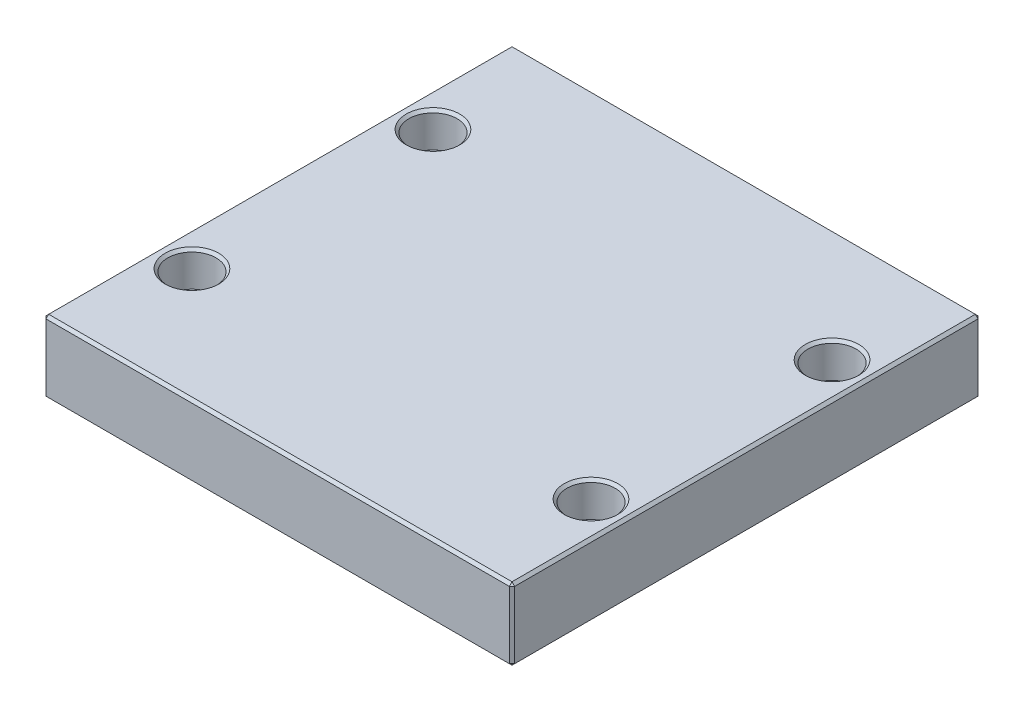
ISO-10303-21;
HEADER;
FILE_DESCRIPTION(('STEP AP214'),'2;1');
FILE_NAME('part.step','',(''),(''),'','','');
FILE_SCHEMA(('AUTOMOTIVE_DESIGN { 1 0 10303 214 1 1 1 1 }'));
ENDSEC;
DATA;
#1=APPLICATION_CONTEXT('core data for automotive mechanical design processes');
#2=APPLICATION_PROTOCOL_DEFINITION('international standard','automotive_design',2000,#1);
#3=PRODUCT_CONTEXT('',#1,'mechanical');
#4=PRODUCT('Part','Part','',(#3));
#5=PRODUCT_RELATED_PRODUCT_CATEGORY('part','',(#4));
#6=PRODUCT_DEFINITION_FORMATION('','',#4);
#7=PRODUCT_DEFINITION_CONTEXT('part definition',#1,'design');
#8=PRODUCT_DEFINITION('design','',#6,#7);
#9=PRODUCT_DEFINITION_SHAPE('','',#8);
#10=(LENGTH_UNIT() NAMED_UNIT(*) SI_UNIT(.MILLI.,.METRE.));
#11=(NAMED_UNIT(*) PLANE_ANGLE_UNIT() SI_UNIT($,.RADIAN.));
#12=(NAMED_UNIT(*) SI_UNIT($,.STERADIAN.) SOLID_ANGLE_UNIT());
#13=UNCERTAINTY_MEASURE_WITH_UNIT(LENGTH_MEASURE(1.E-05),#10,'distance_accuracy_value','');
#14=(GEOMETRIC_REPRESENTATION_CONTEXT(3) GLOBAL_UNCERTAINTY_ASSIGNED_CONTEXT((#13)) GLOBAL_UNIT_ASSIGNED_CONTEXT((#10,
#11,#12)) REPRESENTATION_CONTEXT('',''));
#15=CARTESIAN_POINT('',(0.,0.,0.));
#16=DIRECTION('',(0.,0.,1.));
#17=DIRECTION('',(1.,0.,0.));
#18=AXIS2_PLACEMENT_3D('',#15,#16,#17);
#19=CARTESIAN_POINT('',(-87.5,27.,87.5));
#20=DIRECTION('',(1.,0.,0.));
#21=DIRECTION('',(0.,0.,-1.));
#22=AXIS2_PLACEMENT_3D('',#19,#20,#21);
#23=PLANE('',#22);
#24=DIRECTION('',(0.,-1.,0.));
#25=VECTOR('',#24,1.);
#26=CARTESIAN_POINT('',(-87.5,27.,-86.5));
#27=LINE('',#26,#25);
#28=CARTESIAN_POINT('',(-87.5,26.,-86.5));
#29=VERTEX_POINT('',#28);
#30=CARTESIAN_POINT('',(-87.5,1.,-86.5));
#31=VERTEX_POINT('',#30);
#32=EDGE_CURVE('E115',#29,#31,#27,.T.);
#33=ORIENTED_EDGE('',*,*,#32,.T.);
#34=DIRECTION('',(0.,0.,1.));
#35=VECTOR('',#34,1.);
#36=CARTESIAN_POINT('',(-87.5,1.,87.5));
#37=LINE('',#36,#35);
#38=CARTESIAN_POINT('',(-87.5,1.,86.5));
#39=VERTEX_POINT('',#38);
#40=EDGE_CURVE('E111',#31,#39,#37,.T.);
#41=ORIENTED_EDGE('',*,*,#40,.T.);
#42=DIRECTION('',(0.,1.,0.));
#43=VECTOR('',#42,1.);
#44=CARTESIAN_POINT('',(-87.5,27.,86.5));
#45=LINE('',#44,#43);
#46=CARTESIAN_POINT('',(-87.5,26.,86.5));
#47=VERTEX_POINT('',#46);
#48=EDGE_CURVE('E104',#39,#47,#45,.T.);
#49=ORIENTED_EDGE('',*,*,#48,.T.);
#50=DIRECTION('',(0.,0.,-1.));
#51=VECTOR('',#50,1.);
#52=CARTESIAN_POINT('',(-87.5,26.,-87.5));
#53=LINE('',#52,#51);
#54=EDGE_CURVE('E108',#47,#29,#53,.T.);
#55=ORIENTED_EDGE('',*,*,#54,.T.);
#56=EDGE_LOOP('',(#33,#41,#49,#55));
#57=FACE_BOUND('',#56,.T.);
#58=ADVANCED_FACE('F16',(#57),#23,.F.);
#59=CARTESIAN_POINT('',(87.5,27.,87.5));
#60=DIRECTION('',(0.,0.,-1.));
#61=DIRECTION('',(-1.,0.,0.));
#62=AXIS2_PLACEMENT_3D('',#59,#60,#61);
#63=PLANE('',#62);
#64=DIRECTION('',(-1.,0.,0.));
#65=VECTOR('',#64,1.);
#66=CARTESIAN_POINT('',(-87.5,26.,87.5));
#67=LINE('',#66,#65);
#68=CARTESIAN_POINT('',(86.5,26.,87.5));
#69=VERTEX_POINT('',#68);
#70=CARTESIAN_POINT('',(-86.5,26.,87.5));
#71=VERTEX_POINT('',#70);
#72=EDGE_CURVE('E170',#69,#71,#67,.T.);
#73=ORIENTED_EDGE('',*,*,#72,.T.);
#74=DIRECTION('',(0.,-1.,0.));
#75=VECTOR('',#74,1.);
#76=CARTESIAN_POINT('',(-86.5,27.,87.5));
#77=LINE('',#76,#75);
#78=CARTESIAN_POINT('',(-86.5,1.,87.5));
#79=VERTEX_POINT('',#78);
#80=EDGE_CURVE('E123',#71,#79,#77,.T.);
#81=ORIENTED_EDGE('',*,*,#80,.T.);
#82=DIRECTION('',(1.,0.,0.));
#83=VECTOR('',#82,1.);
#84=CARTESIAN_POINT('',(87.5,1.,87.5));
#85=LINE('',#84,#83);
#86=CARTESIAN_POINT('',(86.5,1.,87.5));
#87=VERTEX_POINT('',#86);
#88=EDGE_CURVE('E174',#79,#87,#85,.T.);
#89=ORIENTED_EDGE('',*,*,#88,.T.);
#90=DIRECTION('',(0.,1.,0.));
#91=VECTOR('',#90,1.);
#92=CARTESIAN_POINT('',(86.5,27.,87.5));
#93=LINE('',#92,#91);
#94=EDGE_CURVE('E172',#87,#69,#93,.T.);
#95=ORIENTED_EDGE('',*,*,#94,.T.);
#96=EDGE_LOOP('',(#73,#81,#89,#95));
#97=FACE_BOUND('',#96,.T.);
#98=ADVANCED_FACE('F317',(#97),#63,.F.);
#99=CARTESIAN_POINT('',(87.5,27.,87.5));
#100=DIRECTION('',(-1.,0.,0.));
#101=DIRECTION('',(0.,0.,1.));
#102=AXIS2_PLACEMENT_3D('',#99,#100,#101);
#103=PLANE('',#102);
#104=DIRECTION('',(0.,0.,-1.));
#105=VECTOR('',#104,1.);
#106=CARTESIAN_POINT('',(87.5,1.,87.5));
#107=LINE('',#106,#105);
#108=CARTESIAN_POINT('',(87.5,1.,86.5));
#109=VERTEX_POINT('',#108);
#110=CARTESIAN_POINT('',(87.5,1.,-86.5));
#111=VERTEX_POINT('',#110);
#112=EDGE_CURVE('E165',#109,#111,#107,.T.);
#113=ORIENTED_EDGE('',*,*,#112,.T.);
#114=DIRECTION('',(0.,1.,0.));
#115=VECTOR('',#114,1.);
#116=CARTESIAN_POINT('',(87.5,27.,-86.5));
#117=LINE('',#116,#115);
#118=CARTESIAN_POINT('',(87.5,26.,-86.5));
#119=VERTEX_POINT('',#118);
#120=EDGE_CURVE('E167',#111,#119,#117,.T.);
#121=ORIENTED_EDGE('',*,*,#120,.T.);
#122=DIRECTION('',(0.,0.,1.));
#123=VECTOR('',#122,1.);
#124=CARTESIAN_POINT('',(87.5,26.,87.5));
#125=LINE('',#124,#123);
#126=CARTESIAN_POINT('',(87.5,26.,86.5));
#127=VERTEX_POINT('',#126);
#128=EDGE_CURVE('E161',#119,#127,#125,.T.);
#129=ORIENTED_EDGE('',*,*,#128,.T.);
#130=DIRECTION('',(0.,-1.,0.));
#131=VECTOR('',#130,1.);
#132=CARTESIAN_POINT('',(87.5,27.,86.5));
#133=LINE('',#132,#131);
#134=EDGE_CURVE('E163',#127,#109,#133,.T.);
#135=ORIENTED_EDGE('',*,*,#134,.T.);
#136=EDGE_LOOP('',(#113,#121,#129,#135));
#137=FACE_BOUND('',#136,.T.);
#138=ADVANCED_FACE('F323',(#137),#103,.F.);
#139=CARTESIAN_POINT('',(87.5,27.,-87.5));
#140=DIRECTION('',(0.,0.,1.));
#141=DIRECTION('',(1.,0.,0.));
#142=AXIS2_PLACEMENT_3D('',#139,#140,#141);
#143=PLANE('',#142);
#144=DIRECTION('',(0.,-1.,0.));
#145=VECTOR('',#144,1.);
#146=CARTESIAN_POINT('',(86.5,27.,-87.5));
#147=LINE('',#146,#145);
#148=CARTESIAN_POINT('',(86.5,26.,-87.5));
#149=VERTEX_POINT('',#148);
#150=CARTESIAN_POINT('',(86.5,1.,-87.5));
#151=VERTEX_POINT('',#150);
#152=EDGE_CURVE('E154',#149,#151,#147,.T.);
#153=ORIENTED_EDGE('',*,*,#152,.T.);
#154=DIRECTION('',(-1.,0.,0.));
#155=VECTOR('',#154,1.);
#156=CARTESIAN_POINT('',(87.5,1.,-87.5));
#157=LINE('',#156,#155);
#158=CARTESIAN_POINT('',(-86.5,1.,-87.5));
#159=VERTEX_POINT('',#158);
#160=EDGE_CURVE('E159',#151,#159,#157,.T.);
#161=ORIENTED_EDGE('',*,*,#160,.T.);
#162=DIRECTION('',(0.,1.,0.));
#163=VECTOR('',#162,1.);
#164=CARTESIAN_POINT('',(-86.5,27.,-87.5));
#165=LINE('',#164,#163);
#166=CARTESIAN_POINT('',(-86.5,26.,-87.5));
#167=VERTEX_POINT('',#166);
#168=EDGE_CURVE('E156',#159,#167,#165,.T.);
#169=ORIENTED_EDGE('',*,*,#168,.T.);
#170=DIRECTION('',(1.,0.,0.));
#171=VECTOR('',#170,1.);
#172=CARTESIAN_POINT('',(87.5,26.,-87.5));
#173=LINE('',#172,#171);
#174=EDGE_CURVE('E152',#167,#149,#173,.T.);
#175=ORIENTED_EDGE('',*,*,#174,.T.);
#176=EDGE_LOOP('',(#153,#161,#169,#175));
#177=FACE_BOUND('',#176,.T.);
#178=ADVANCED_FACE('F465',(#177),#143,.F.);
#179=CARTESIAN_POINT('',(0.,27.,0.));
#180=DIRECTION('',(0.,1.,0.));
#181=DIRECTION('',(0.,0.,1.));
#182=AXIS2_PLACEMENT_3D('',#179,#180,#181);
#183=PLANE('',#182);
#184=CARTESIAN_POINT('',(-74.5,27.,45.));
#185=DIRECTION('',(0.,1.,0.));
#186=DIRECTION('',(0.,0.,1.));
#187=AXIS2_PLACEMENT_3D('',#184,#185,#186);
#188=CIRCLE('',#187,10.);
#189=CARTESIAN_POINT('',(-74.5,27.,55.));
#190=VERTEX_POINT('',#189);
#191=EDGE_CURVE('E290',#190,#190,#188,.F.);
#192=ORIENTED_EDGE('',*,*,#191,.T.);
#193=EDGE_LOOP('',(#192));
#194=FACE_BOUND('',#193,.T.);
#195=CARTESIAN_POINT('',(74.5,27.,45.));
#196=DIRECTION('',(0.,1.,0.));
#197=DIRECTION('',(0.,0.,1.));
#198=AXIS2_PLACEMENT_3D('',#195,#196,#197);
#199=CIRCLE('',#198,10.);
#200=CARTESIAN_POINT('',(74.5,27.,55.));
#201=VERTEX_POINT('',#200);
#202=EDGE_CURVE('E287',#201,#201,#199,.F.);
#203=ORIENTED_EDGE('',*,*,#202,.T.);
#204=EDGE_LOOP('',(#203));
#205=FACE_BOUND('',#204,.T.);
#206=CARTESIAN_POINT('',(74.5,27.,-45.));
#207=DIRECTION('',(0.,1.,0.));
#208=DIRECTION('',(0.,0.,1.));
#209=AXIS2_PLACEMENT_3D('',#206,#207,#208);
#210=CIRCLE('',#209,10.);
#211=CARTESIAN_POINT('',(74.5,27.,-35.));
#212=VERTEX_POINT('',#211);
#213=EDGE_CURVE('E284',#212,#212,#210,.F.);
#214=ORIENTED_EDGE('',*,*,#213,.T.);
#215=EDGE_LOOP('',(#214));
#216=FACE_BOUND('',#215,.T.);
#217=CARTESIAN_POINT('',(-74.5,27.,-45.));
#218=DIRECTION('',(0.,1.,0.));
#219=DIRECTION('',(0.,0.,1.));
#220=AXIS2_PLACEMENT_3D('',#217,#218,#219);
#221=CIRCLE('',#220,10.);
#222=CARTESIAN_POINT('',(-74.5,27.,-35.));
#223=VERTEX_POINT('',#222);
#224=EDGE_CURVE('E281',#223,#223,#221,.F.);
#225=ORIENTED_EDGE('',*,*,#224,.T.);
#226=EDGE_LOOP('',(#225));
#227=FACE_BOUND('',#226,.T.);
#228=DIRECTION('',(0.,0.,-1.));
#229=VECTOR('',#228,1.);
#230=CARTESIAN_POINT('',(86.5,27.,-87.5));
#231=LINE('',#230,#229);
#232=CARTESIAN_POINT('',(86.5,27.,86.5));
#233=VERTEX_POINT('',#232);
#234=CARTESIAN_POINT('',(86.5,27.,-86.5));
#235=VERTEX_POINT('',#234);
#236=EDGE_CURVE('E31',#233,#235,#231,.T.);
#237=ORIENTED_EDGE('',*,*,#236,.T.);
#238=DIRECTION('',(-1.,0.,0.));
#239=VECTOR('',#238,1.);
#240=CARTESIAN_POINT('',(-87.5,27.,-86.5));
#241=LINE('',#240,#239);
#242=CARTESIAN_POINT('',(-86.5,27.,-86.5));
#243=VERTEX_POINT('',#242);
#244=EDGE_CURVE('E190',#235,#243,#241,.T.);
#245=ORIENTED_EDGE('',*,*,#244,.T.);
#246=DIRECTION('',(0.,0.,1.));
#247=VECTOR('',#246,1.);
#248=CARTESIAN_POINT('',(-86.5,27.,87.5));
#249=LINE('',#248,#247);
#250=CARTESIAN_POINT('',(-86.5,27.,86.5));
#251=VERTEX_POINT('',#250);
#252=EDGE_CURVE('E186',#243,#251,#249,.T.);
#253=ORIENTED_EDGE('',*,*,#252,.T.);
#254=DIRECTION('',(1.,0.,0.));
#255=VECTOR('',#254,1.);
#256=CARTESIAN_POINT('',(87.5,27.,86.5));
#257=LINE('',#256,#255);
#258=EDGE_CURVE('E36',#251,#233,#257,.T.);
#259=ORIENTED_EDGE('',*,*,#258,.T.);
#260=EDGE_LOOP('',(#237,#245,#253,#259));
#261=FACE_BOUND('',#260,.T.);
#262=ADVANCED_FACE('F462',(#194,#205,#216,#227,#261),#183,.T.);
#263=CARTESIAN_POINT('',(0.,0.,0.));
#264=DIRECTION('',(0.,1.,0.));
#265=DIRECTION('',(0.,0.,1.));
#266=AXIS2_PLACEMENT_3D('',#263,#264,#265);
#267=PLANE('',#266);
#268=CARTESIAN_POINT('',(74.5,0.,-45.));
#269=DIRECTION('',(0.,1.,0.));
#270=DIRECTION('',(0.,0.,1.));
#271=AXIS2_PLACEMENT_3D('',#268,#269,#270);
#272=CIRCLE('',#271,6.5);
#273=CARTESIAN_POINT('',(74.5,0.,-38.5));
#274=VERTEX_POINT('',#273);
#275=EDGE_CURVE('E263',#274,#274,#272,.T.);
#276=ORIENTED_EDGE('',*,*,#275,.T.);
#277=EDGE_LOOP('',(#276));
#278=FACE_BOUND('',#277,.T.);
#279=CARTESIAN_POINT('',(74.5,0.,45.));
#280=DIRECTION('',(0.,1.,0.));
#281=DIRECTION('',(0.,0.,1.));
#282=AXIS2_PLACEMENT_3D('',#279,#280,#281);
#283=CIRCLE('',#282,6.5);
#284=CARTESIAN_POINT('',(74.5,0.,51.5));
#285=VERTEX_POINT('',#284);
#286=EDGE_CURVE('E260',#285,#285,#283,.T.);
#287=ORIENTED_EDGE('',*,*,#286,.T.);
#288=EDGE_LOOP('',(#287));
#289=FACE_BOUND('',#288,.T.);
#290=CARTESIAN_POINT('',(-74.5,0.,45.));
#291=DIRECTION('',(0.,1.,0.));
#292=DIRECTION('',(0.,0.,1.));
#293=AXIS2_PLACEMENT_3D('',#290,#291,#292);
#294=CIRCLE('',#293,6.5);
#295=CARTESIAN_POINT('',(-74.5,0.,51.5));
#296=VERTEX_POINT('',#295);
#297=EDGE_CURVE('E257',#296,#296,#294,.T.);
#298=ORIENTED_EDGE('',*,*,#297,.T.);
#299=EDGE_LOOP('',(#298));
#300=FACE_BOUND('',#299,.T.);
#301=CARTESIAN_POINT('',(-74.5,0.,-45.));
#302=DIRECTION('',(0.,1.,0.));
#303=DIRECTION('',(0.,0.,1.));
#304=AXIS2_PLACEMENT_3D('',#301,#302,#303);
#305=CIRCLE('',#304,6.5);
#306=CARTESIAN_POINT('',(-74.5,0.,-38.5));
#307=VERTEX_POINT('',#306);
#308=EDGE_CURVE('E192',#307,#307,#305,.T.);
#309=ORIENTED_EDGE('',*,*,#308,.T.);
#310=EDGE_LOOP('',(#309));
#311=FACE_BOUND('',#310,.T.);
#312=DIRECTION('',(0.,0.,1.));
#313=VECTOR('',#312,1.);
#314=CARTESIAN_POINT('',(86.5,0.,0.));
#315=LINE('',#314,#313);
#316=CARTESIAN_POINT('',(86.5,0.,-86.5));
#317=VERTEX_POINT('',#316);
#318=CARTESIAN_POINT('',(86.5,0.,86.5));
#319=VERTEX_POINT('',#318);
#320=EDGE_CURVE('E177',#317,#319,#315,.T.);
#321=ORIENTED_EDGE('',*,*,#320,.T.);
#322=DIRECTION('',(-1.,0.,0.));
#323=VECTOR('',#322,1.);
#324=CARTESIAN_POINT('',(0.,0.,86.5));
#325=LINE('',#324,#323);
#326=CARTESIAN_POINT('',(-86.5,0.,86.5));
#327=VERTEX_POINT('',#326);
#328=EDGE_CURVE('E183',#319,#327,#325,.T.);
#329=ORIENTED_EDGE('',*,*,#328,.T.);
#330=DIRECTION('',(0.,0.,-1.));
#331=VECTOR('',#330,1.);
#332=CARTESIAN_POINT('',(-86.5,0.,0.));
#333=LINE('',#332,#331);
#334=CARTESIAN_POINT('',(-86.5,0.,-86.5));
#335=VERTEX_POINT('',#334);
#336=EDGE_CURVE('E181',#327,#335,#333,.T.);
#337=ORIENTED_EDGE('',*,*,#336,.T.);
#338=DIRECTION('',(1.,0.,0.));
#339=VECTOR('',#338,1.);
#340=CARTESIAN_POINT('',(0.,0.,-86.5));
#341=LINE('',#340,#339);
#342=EDGE_CURVE('E179',#335,#317,#341,.T.);
#343=ORIENTED_EDGE('',*,*,#342,.T.);
#344=EDGE_LOOP('',(#321,#329,#337,#343));
#345=FACE_BOUND('',#344,.T.);
#346=ADVANCED_FACE('F402',(#278,#289,#300,#311,#345),#267,.F.);
#347=CARTESIAN_POINT('',(87.5,27.,86.5));
#348=DIRECTION('',(-0.707106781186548,0.,-0.707106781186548));
#349=DIRECTION('',(0.,-1.,0.));
#350=AXIS2_PLACEMENT_3D('',#347,#348,#349);
#351=PLANE('',#350);
#352=DIRECTION('',(-0.707106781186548,0.,0.707106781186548));
#353=VECTOR('',#352,1.);
#354=CARTESIAN_POINT('',(86.5,26.,87.5));
#355=LINE('',#354,#353);
#356=EDGE_CURVE('E141',#69,#127,#355,.F.);
#357=ORIENTED_EDGE('',*,*,#356,.F.);
#358=ORIENTED_EDGE('',*,*,#94,.F.);
#359=DIRECTION('',(0.707106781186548,0.,-0.707106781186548));
#360=VECTOR('',#359,1.);
#361=CARTESIAN_POINT('',(86.5,1.,87.5));
#362=LINE('',#361,#360);
#363=EDGE_CURVE('E144',#109,#87,#362,.F.);
#364=ORIENTED_EDGE('',*,*,#363,.F.);
#365=ORIENTED_EDGE('',*,*,#134,.F.);
#366=EDGE_LOOP('',(#357,#358,#364,#365));
#367=FACE_BOUND('',#366,.T.);
#368=ADVANCED_FACE('F398',(#367),#351,.F.);
#369=CARTESIAN_POINT('',(86.5,26.,87.5));
#370=DIRECTION('',(0.577350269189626,0.577350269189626,0.577350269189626));
#371=DIRECTION('',(0.707106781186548,0.,-0.707106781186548));
#372=AXIS2_PLACEMENT_3D('',#369,#370,#371);
#373=PLANE('',#372);
#374=DIRECTION('',(0.,-0.70710678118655,0.707106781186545));
#375=VECTOR('',#374,1.);
#376=CARTESIAN_POINT('',(86.5,26.,87.5));
#377=LINE('',#376,#375);
#378=EDGE_CURVE('E235',#69,#233,#377,.F.);
#379=ORIENTED_EDGE('',*,*,#378,.F.);
#380=ORIENTED_EDGE('',*,*,#356,.T.);
#381=DIRECTION('',(-0.707106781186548,0.707106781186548,0.));
#382=VECTOR('',#381,1.);
#383=CARTESIAN_POINT('',(87.,26.5,86.5));
#384=LINE('',#383,#382);
#385=EDGE_CURVE('E237',#233,#127,#384,.F.);
#386=ORIENTED_EDGE('',*,*,#385,.F.);
#387=EDGE_LOOP('',(#379,#380,#386));
#388=FACE_BOUND('',#387,.T.);
#389=ADVANCED_FACE('F394',(#388),#373,.T.);
#390=CARTESIAN_POINT('',(86.5,1.,87.5));
#391=DIRECTION('',(0.577350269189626,-0.577350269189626,0.577350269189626));
#392=DIRECTION('',(0.707106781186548,0.,-0.707106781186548));
#393=AXIS2_PLACEMENT_3D('',#390,#391,#392);
#394=PLANE('',#393);
#395=DIRECTION('',(-0.707106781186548,-0.707106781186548,0.));
#396=VECTOR('',#395,1.);
#397=CARTESIAN_POINT('',(87.,0.5,86.5));
#398=LINE('',#397,#396);
#399=EDGE_CURVE('E229',#109,#319,#398,.T.);
#400=ORIENTED_EDGE('',*,*,#399,.F.);
#401=ORIENTED_EDGE('',*,*,#363,.T.);
#402=DIRECTION('',(0.,0.70710678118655,0.707106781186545));
#403=VECTOR('',#402,1.);
#404=CARTESIAN_POINT('',(86.5,1.,87.5));
#405=LINE('',#404,#403);
#406=EDGE_CURVE('E232',#319,#87,#405,.T.);
#407=ORIENTED_EDGE('',*,*,#406,.F.);
#408=EDGE_LOOP('',(#400,#401,#407));
#409=FACE_BOUND('',#408,.T.);
#410=ADVANCED_FACE('F390',(#409),#394,.T.);
#411=CARTESIAN_POINT('',(86.5,27.,0.));
#412=DIRECTION('',(0.707106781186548,0.707106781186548,0.));
#413=DIRECTION('',(0.,0.,1.));
#414=AXIS2_PLACEMENT_3D('',#411,#412,#413);
#415=PLANE('',#414);
#416=ORIENTED_EDGE('',*,*,#385,.T.);
#417=ORIENTED_EDGE('',*,*,#128,.F.);
#418=DIRECTION('',(0.707106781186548,-0.707106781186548,0.));
#419=VECTOR('',#418,1.);
#420=CARTESIAN_POINT('',(87.5,26.,-86.5));
#421=LINE('',#420,#419);
#422=EDGE_CURVE('E224',#235,#119,#421,.T.);
#423=ORIENTED_EDGE('',*,*,#422,.F.);
#424=ORIENTED_EDGE('',*,*,#236,.F.);
#425=EDGE_LOOP('',(#416,#417,#423,#424));
#426=FACE_BOUND('',#425,.T.);
#427=ADVANCED_FACE('F386',(#426),#415,.T.);
#428=CARTESIAN_POINT('',(0.,27.,86.5));
#429=DIRECTION('',(0.,0.707106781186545,0.70710678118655));
#430=DIRECTION('',(-1.,0.,0.));
#431=AXIS2_PLACEMENT_3D('',#428,#429,#430);
#432=PLANE('',#431);
#433=ORIENTED_EDGE('',*,*,#378,.T.);
#434=ORIENTED_EDGE('',*,*,#258,.F.);
#435=DIRECTION('',(0.,0.70710678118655,-0.707106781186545));
#436=VECTOR('',#435,1.);
#437=CARTESIAN_POINT('',(-86.5,26.5,87.));
#438=LINE('',#437,#436);
#439=EDGE_CURVE('E127',#71,#251,#438,.T.);
#440=ORIENTED_EDGE('',*,*,#439,.F.);
#441=ORIENTED_EDGE('',*,*,#72,.F.);
#442=EDGE_LOOP('',(#433,#434,#440,#441));
#443=FACE_BOUND('',#442,.T.);
#444=ADVANCED_FACE('F383',(#443),#432,.T.);
#445=CARTESIAN_POINT('',(-86.5,27.,87.5));
#446=DIRECTION('',(0.707106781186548,0.,-0.707106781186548));
#447=DIRECTION('',(0.,-1.,0.));
#448=AXIS2_PLACEMENT_3D('',#445,#446,#447);
#449=PLANE('',#448);
#450=DIRECTION('',(0.707106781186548,0.,0.707106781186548));
#451=VECTOR('',#450,1.);
#452=CARTESIAN_POINT('',(-86.5,1.,87.5));
#453=LINE('',#452,#451);
#454=EDGE_CURVE('E128',#79,#39,#453,.F.);
#455=ORIENTED_EDGE('',*,*,#454,.F.);
#456=ORIENTED_EDGE('',*,*,#80,.F.);
#457=DIRECTION('',(-0.707106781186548,0.,-0.707106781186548));
#458=VECTOR('',#457,1.);
#459=CARTESIAN_POINT('',(-87.5,26.,86.5));
#460=LINE('',#459,#458);
#461=EDGE_CURVE('E119',#47,#71,#460,.F.);
#462=ORIENTED_EDGE('',*,*,#461,.F.);
#463=ORIENTED_EDGE('',*,*,#48,.F.);
#464=EDGE_LOOP('',(#455,#456,#462,#463));
#465=FACE_BOUND('',#464,.T.);
#466=ADVANCED_FACE('F121',(#465),#449,.F.);
#467=CARTESIAN_POINT('',(87.5,1.,87.5));
#468=DIRECTION('',(0.,0.707106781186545,-0.70710678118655));
#469=DIRECTION('',(1.,0.,0.));
#470=AXIS2_PLACEMENT_3D('',#467,#468,#469);
#471=PLANE('',#470);
#472=ORIENTED_EDGE('',*,*,#406,.T.);
#473=ORIENTED_EDGE('',*,*,#88,.F.);
#474=DIRECTION('',(0.,-0.70710678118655,-0.707106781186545));
#475=VECTOR('',#474,1.);
#476=CARTESIAN_POINT('',(-86.5,1.,87.5));
#477=LINE('',#476,#475);
#478=EDGE_CURVE('E220',#327,#79,#477,.F.);
#479=ORIENTED_EDGE('',*,*,#478,.F.);
#480=ORIENTED_EDGE('',*,*,#328,.F.);
#481=EDGE_LOOP('',(#472,#473,#479,#480));
#482=FACE_BOUND('',#481,.T.);
#483=ADVANCED_FACE('F376',(#482),#471,.F.);
#484=CARTESIAN_POINT('',(87.5,1.,87.5));
#485=DIRECTION('',(-0.707106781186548,0.707106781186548,0.));
#486=DIRECTION('',(0.,0.,-1.));
#487=AXIS2_PLACEMENT_3D('',#484,#485,#486);
#488=PLANE('',#487);
#489=ORIENTED_EDGE('',*,*,#399,.T.);
#490=ORIENTED_EDGE('',*,*,#320,.F.);
#491=DIRECTION('',(0.707106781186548,0.707106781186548,0.));
#492=VECTOR('',#491,1.);
#493=CARTESIAN_POINT('',(87.,0.500000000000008,-86.5));
#494=LINE('',#493,#492);
#495=EDGE_CURVE('E217',#111,#317,#494,.F.);
#496=ORIENTED_EDGE('',*,*,#495,.F.);
#497=ORIENTED_EDGE('',*,*,#112,.F.);
#498=EDGE_LOOP('',(#489,#490,#496,#497));
#499=FACE_BOUND('',#498,.T.);
#500=ADVANCED_FACE('F372',(#499),#488,.F.);
#501=CARTESIAN_POINT('',(86.5,27.,-87.5));
#502=DIRECTION('',(-0.707106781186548,0.,0.707106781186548));
#503=DIRECTION('',(0.,-1.,0.));
#504=AXIS2_PLACEMENT_3D('',#501,#502,#503);
#505=PLANE('',#504);
#506=DIRECTION('',(0.707106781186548,0.,0.707106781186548));
#507=VECTOR('',#506,1.);
#508=CARTESIAN_POINT('',(87.5,26.,-86.5));
#509=LINE('',#508,#507);
#510=EDGE_CURVE('E226',#119,#149,#509,.F.);
#511=ORIENTED_EDGE('',*,*,#510,.F.);
#512=ORIENTED_EDGE('',*,*,#120,.F.);
#513=DIRECTION('',(-0.707106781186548,0.,-0.707106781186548));
#514=VECTOR('',#513,1.);
#515=CARTESIAN_POINT('',(86.5,1.,-87.5));
#516=LINE('',#515,#514);
#517=EDGE_CURVE('E214',#151,#111,#516,.F.);
#518=ORIENTED_EDGE('',*,*,#517,.F.);
#519=ORIENTED_EDGE('',*,*,#152,.F.);
#520=EDGE_LOOP('',(#511,#512,#518,#519));
#521=FACE_BOUND('',#520,.T.);
#522=ADVANCED_FACE('F368',(#521),#505,.F.);
#523=CARTESIAN_POINT('',(87.5,26.,-86.5));
#524=DIRECTION('',(0.577350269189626,0.577350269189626,-0.577350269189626));
#525=DIRECTION('',(-0.707106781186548,0.,-0.707106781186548));
#526=AXIS2_PLACEMENT_3D('',#523,#524,#525);
#527=PLANE('',#526);
#528=ORIENTED_EDGE('',*,*,#422,.T.);
#529=ORIENTED_EDGE('',*,*,#510,.T.);
#530=DIRECTION('',(0.,0.707106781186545,0.70710678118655));
#531=VECTOR('',#530,1.);
#532=CARTESIAN_POINT('',(86.5,26.5,-87.));
#533=LINE('',#532,#531);
#534=EDGE_CURVE('E135',#235,#149,#533,.F.);
#535=ORIENTED_EDGE('',*,*,#534,.F.);
#536=EDGE_LOOP('',(#528,#529,#535));
#537=FACE_BOUND('',#536,.T.);
#538=ADVANCED_FACE('F365',(#537),#527,.T.);
#539=CARTESIAN_POINT('',(-87.5,26.,86.5));
#540=DIRECTION('',(-0.577350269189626,0.577350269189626,0.577350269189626));
#541=DIRECTION('',(0.707106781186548,0.,0.707106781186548));
#542=AXIS2_PLACEMENT_3D('',#539,#540,#541);
#543=PLANE('',#542);
#544=ORIENTED_EDGE('',*,*,#461,.T.);
#545=ORIENTED_EDGE('',*,*,#439,.T.);
#546=DIRECTION('',(-0.707106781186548,-0.707106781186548,0.));
#547=VECTOR('',#546,1.);
#548=CARTESIAN_POINT('',(-87.5,26.,86.5));
#549=LINE('',#548,#547);
#550=EDGE_CURVE('E131',#47,#251,#549,.F.);
#551=ORIENTED_EDGE('',*,*,#550,.F.);
#552=EDGE_LOOP('',(#544,#545,#551));
#553=FACE_BOUND('',#552,.T.);
#554=ADVANCED_FACE('F132',(#553),#543,.T.);
#555=CARTESIAN_POINT('',(-86.5,1.,87.5));
#556=DIRECTION('',(-0.577350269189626,-0.577350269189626,0.577350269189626));
#557=DIRECTION('',(0.707106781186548,0.,0.707106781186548));
#558=AXIS2_PLACEMENT_3D('',#555,#556,#557);
#559=PLANE('',#558);
#560=ORIENTED_EDGE('',*,*,#478,.T.);
#561=ORIENTED_EDGE('',*,*,#454,.T.);
#562=DIRECTION('',(-0.707106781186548,0.707106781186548,0.));
#563=VECTOR('',#562,1.);
#564=CARTESIAN_POINT('',(-87.,0.5,86.5));
#565=LINE('',#564,#563);
#566=EDGE_CURVE('E136',#327,#39,#565,.T.);
#567=ORIENTED_EDGE('',*,*,#566,.F.);
#568=EDGE_LOOP('',(#560,#561,#567));
#569=FACE_BOUND('',#568,.T.);
#570=ADVANCED_FACE('F358',(#569),#559,.T.);
#571=CARTESIAN_POINT('',(86.5,1.,-87.5));
#572=DIRECTION('',(0.577350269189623,-0.577350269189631,-0.577350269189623));
#573=DIRECTION('',(0.,0.707106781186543,-0.707106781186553));
#574=AXIS2_PLACEMENT_3D('',#571,#572,#573);
#575=PLANE('',#574);
#576=ORIENTED_EDGE('',*,*,#517,.T.);
#577=ORIENTED_EDGE('',*,*,#495,.T.);
#578=DIRECTION('',(0.,-0.707106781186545,0.70710678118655));
#579=VECTOR('',#578,1.);
#580=CARTESIAN_POINT('',(86.5,1.,-87.5));
#581=LINE('',#580,#579);
#582=EDGE_CURVE('E207',#151,#317,#581,.T.);
#583=ORIENTED_EDGE('',*,*,#582,.F.);
#584=EDGE_LOOP('',(#576,#577,#583));
#585=FACE_BOUND('',#584,.T.);
#586=ADVANCED_FACE('F354',(#585),#575,.T.);
#587=CARTESIAN_POINT('',(0.,27.,-86.5));
#588=DIRECTION('',(0.,0.70710678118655,-0.707106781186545));
#589=DIRECTION('',(1.,0.,0.));
#590=AXIS2_PLACEMENT_3D('',#587,#588,#589);
#591=PLANE('',#590);
#592=ORIENTED_EDGE('',*,*,#534,.T.);
#593=ORIENTED_EDGE('',*,*,#174,.F.);
#594=DIRECTION('',(0.,-0.707106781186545,-0.70710678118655));
#595=VECTOR('',#594,1.);
#596=CARTESIAN_POINT('',(-86.5,26.,-87.5));
#597=LINE('',#596,#595);
#598=EDGE_CURVE('E204',#243,#167,#597,.T.);
#599=ORIENTED_EDGE('',*,*,#598,.F.);
#600=ORIENTED_EDGE('',*,*,#244,.F.);
#601=EDGE_LOOP('',(#592,#593,#599,#600));
#602=FACE_BOUND('',#601,.T.);
#603=ADVANCED_FACE('F351',(#602),#591,.T.);
#604=CARTESIAN_POINT('',(-86.5,27.,0.));
#605=DIRECTION('',(-0.707106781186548,0.707106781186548,0.));
#606=DIRECTION('',(0.,0.,-1.));
#607=AXIS2_PLACEMENT_3D('',#604,#605,#606);
#608=PLANE('',#607);
#609=ORIENTED_EDGE('',*,*,#550,.T.);
#610=ORIENTED_EDGE('',*,*,#252,.F.);
#611=DIRECTION('',(0.707106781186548,0.707106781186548,0.));
#612=VECTOR('',#611,1.);
#613=CARTESIAN_POINT('',(-87.,26.5,-86.5));
#614=LINE('',#613,#612);
#615=EDGE_CURVE('E139',#29,#243,#614,.T.);
#616=ORIENTED_EDGE('',*,*,#615,.F.);
#617=ORIENTED_EDGE('',*,*,#54,.F.);
#618=EDGE_LOOP('',(#609,#610,#616,#617));
#619=FACE_BOUND('',#618,.T.);
#620=ADVANCED_FACE('F138',(#619),#608,.T.);
#621=CARTESIAN_POINT('',(-87.5,1.,87.5));
#622=DIRECTION('',(0.707106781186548,0.707106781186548,0.));
#623=DIRECTION('',(0.,0.,1.));
#624=AXIS2_PLACEMENT_3D('',#621,#622,#623);
#625=PLANE('',#624);
#626=ORIENTED_EDGE('',*,*,#566,.T.);
#627=ORIENTED_EDGE('',*,*,#40,.F.);
#628=DIRECTION('',(0.707106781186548,-0.707106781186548,0.));
#629=VECTOR('',#628,1.);
#630=CARTESIAN_POINT('',(-87.5,1.,-86.5));
#631=LINE('',#630,#629);
#632=EDGE_CURVE('E200',#335,#31,#631,.F.);
#633=ORIENTED_EDGE('',*,*,#632,.F.);
#634=ORIENTED_EDGE('',*,*,#336,.F.);
#635=EDGE_LOOP('',(#626,#627,#633,#634));
#636=FACE_BOUND('',#635,.T.);
#637=ADVANCED_FACE('F344',(#636),#625,.F.);
#638=CARTESIAN_POINT('',(87.5,1.,-87.5));
#639=DIRECTION('',(0.,0.70710678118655,0.707106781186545));
#640=DIRECTION('',(-1.,0.,0.));
#641=AXIS2_PLACEMENT_3D('',#638,#639,#640);
#642=PLANE('',#641);
#643=ORIENTED_EDGE('',*,*,#582,.T.);
#644=ORIENTED_EDGE('',*,*,#342,.F.);
#645=DIRECTION('',(0.,0.707106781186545,-0.70710678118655));
#646=VECTOR('',#645,1.);
#647=CARTESIAN_POINT('',(-86.5,0.500000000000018,-87.));
#648=LINE('',#647,#646);
#649=EDGE_CURVE('E197',#159,#335,#648,.F.);
#650=ORIENTED_EDGE('',*,*,#649,.F.);
#651=ORIENTED_EDGE('',*,*,#160,.F.);
#652=EDGE_LOOP('',(#643,#644,#650,#651));
#653=FACE_BOUND('',#652,.T.);
#654=ADVANCED_FACE('F340',(#653),#642,.F.);
#655=CARTESIAN_POINT('',(-86.5,26.,-87.5));
#656=DIRECTION('',(-0.577350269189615,0.577350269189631,-0.577350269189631));
#657=DIRECTION('',(0.,0.707106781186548,0.707106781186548));
#658=AXIS2_PLACEMENT_3D('',#655,#656,#657);
#659=PLANE('',#658);
#660=ORIENTED_EDGE('',*,*,#615,.T.);
#661=ORIENTED_EDGE('',*,*,#598,.T.);
#662=DIRECTION('',(0.707106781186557,0.,-0.707106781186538));
#663=VECTOR('',#662,1.);
#664=CARTESIAN_POINT('',(-86.5,26.,-87.5));
#665=LINE('',#664,#663);
#666=EDGE_CURVE('E195',#29,#167,#665,.T.);
#667=ORIENTED_EDGE('',*,*,#666,.F.);
#668=EDGE_LOOP('',(#660,#661,#667));
#669=FACE_BOUND('',#668,.T.);
#670=ADVANCED_FACE('F336',(#669),#659,.T.);
#671=CARTESIAN_POINT('',(-87.5,1.,-86.5));
#672=DIRECTION('',(-0.577350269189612,-0.577350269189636,-0.577350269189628));
#673=DIRECTION('',(0.,0.707106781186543,-0.707106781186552));
#674=AXIS2_PLACEMENT_3D('',#671,#672,#673);
#675=PLANE('',#674);
#676=ORIENTED_EDGE('',*,*,#649,.T.);
#677=ORIENTED_EDGE('',*,*,#632,.T.);
#678=DIRECTION('',(-0.707106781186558,0.,0.707106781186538));
#679=VECTOR('',#678,1.);
#680=CARTESIAN_POINT('',(-87.5,1.,-86.5));
#681=LINE('',#680,#679);
#682=EDGE_CURVE('E193',#159,#31,#681,.T.);
#683=ORIENTED_EDGE('',*,*,#682,.F.);
#684=EDGE_LOOP('',(#676,#677,#683));
#685=FACE_BOUND('',#684,.T.);
#686=ADVANCED_FACE('F332',(#685),#675,.T.);
#687=CARTESIAN_POINT('',(-87.5,27.,-86.5));
#688=DIRECTION('',(0.707106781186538,0.,0.707106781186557));
#689=DIRECTION('',(0.,-1.,0.));
#690=AXIS2_PLACEMENT_3D('',#687,#688,#689);
#691=PLANE('',#690);
#692=ORIENTED_EDGE('',*,*,#666,.T.);
#693=ORIENTED_EDGE('',*,*,#168,.F.);
#694=ORIENTED_EDGE('',*,*,#682,.T.);
#695=ORIENTED_EDGE('',*,*,#32,.F.);
#696=EDGE_LOOP('',(#692,#693,#694,#695));
#697=FACE_BOUND('',#696,.T.);
#698=ADVANCED_FACE('F328',(#697),#691,.F.);
#699=CARTESIAN_POINT('',(-74.5,14.,-45.));
#700=DIRECTION('',(0.,1.,0.));
#701=DIRECTION('',(0.,0.,1.));
#702=AXIS2_PLACEMENT_3D('',#699,#700,#701);
#703=CYLINDRICAL_SURFACE('',#702,9.);
#704=CARTESIAN_POINT('',(-74.5,26.,-45.));
#705=DIRECTION('',(0.,1.,0.));
#706=DIRECTION('',(0.,0.,1.));
#707=AXIS2_PLACEMENT_3D('',#704,#705,#706);
#708=CIRCLE('',#707,9.);
#709=CARTESIAN_POINT('',(-74.5,26.,-36.));
#710=VERTEX_POINT('',#709);
#711=EDGE_CURVE('E10',#710,#710,#708,.T.);
#712=ORIENTED_EDGE('',*,*,#711,.T.);
#713=EDGE_LOOP('',(#712));
#714=FACE_BOUND('',#713,.T.);
#715=CARTESIAN_POINT('',(-74.5,14.,-45.));
#716=DIRECTION('',(0.,1.,0.));
#717=DIRECTION('',(0.,0.,1.));
#718=AXIS2_PLACEMENT_3D('',#715,#716,#717);
#719=CIRCLE('',#718,9.);
#720=CARTESIAN_POINT('',(-74.5,14.,-36.));
#721=VERTEX_POINT('',#720);
#722=EDGE_CURVE('E147',#721,#721,#719,.T.);
#723=ORIENTED_EDGE('',*,*,#722,.F.);
#724=EDGE_LOOP('',(#723));
#725=FACE_BOUND('',#724,.T.);
#726=ADVANCED_FACE('F331',(#714,#725),#703,.F.);
#727=CARTESIAN_POINT('',(-74.5,14.,-45.));
#728=DIRECTION('',(0.,1.,0.));
#729=DIRECTION('',(0.,0.,1.));
#730=AXIS2_PLACEMENT_3D('',#727,#728,#729);
#731=PLANE('',#730);
#732=CARTESIAN_POINT('',(-74.5,14.,-45.));
#733=DIRECTION('',(0.,1.,0.));
#734=DIRECTION('',(0.,0.,1.));
#735=AXIS2_PLACEMENT_3D('',#732,#733,#734);
#736=CIRCLE('',#735,5.5);
#737=CARTESIAN_POINT('',(-74.5,14.,-39.5));
#738=VERTEX_POINT('',#737);
#739=EDGE_CURVE('E251',#738,#738,#736,.T.);
#740=ORIENTED_EDGE('',*,*,#739,.F.);
#741=EDGE_LOOP('',(#740));
#742=FACE_BOUND('',#741,.T.);
#743=ORIENTED_EDGE('',*,*,#722,.T.);
#744=EDGE_LOOP('',(#743));
#745=FACE_BOUND('',#744,.T.);
#746=ADVANCED_FACE('F450',(#742,#745),#731,.T.);
#747=CARTESIAN_POINT('',(74.5,14.,-45.));
#748=DIRECTION('',(0.,1.,0.));
#749=DIRECTION('',(0.,0.,1.));
#750=AXIS2_PLACEMENT_3D('',#747,#748,#749);
#751=CYLINDRICAL_SURFACE('',#750,9.);
#752=CARTESIAN_POINT('',(74.5,26.,-45.));
#753=DIRECTION('',(0.,1.,0.));
#754=DIRECTION('',(0.,0.,1.));
#755=AXIS2_PLACEMENT_3D('',#752,#753,#754);
#756=CIRCLE('',#755,9.);
#757=CARTESIAN_POINT('',(74.5,26.,-36.));
#758=VERTEX_POINT('',#757);
#759=EDGE_CURVE('E24',#758,#758,#756,.T.);
#760=ORIENTED_EDGE('',*,*,#759,.T.);
#761=EDGE_LOOP('',(#760));
#762=FACE_BOUND('',#761,.T.);
#763=CARTESIAN_POINT('',(74.5,14.,-45.));
#764=DIRECTION('',(0.,1.,0.));
#765=DIRECTION('',(0.,0.,1.));
#766=AXIS2_PLACEMENT_3D('',#763,#764,#765);
#767=CIRCLE('',#766,9.);
#768=CARTESIAN_POINT('',(74.5,14.,-36.));
#769=VERTEX_POINT('',#768);
#770=EDGE_CURVE('E441',#769,#769,#767,.T.);
#771=ORIENTED_EDGE('',*,*,#770,.F.);
#772=EDGE_LOOP('',(#771));
#773=FACE_BOUND('',#772,.T.);
#774=ADVANCED_FACE('F298',(#762,#773),#751,.F.);
#775=CARTESIAN_POINT('',(74.5,14.,-45.));
#776=DIRECTION('',(0.,1.,0.));
#777=DIRECTION('',(0.,0.,1.));
#778=AXIS2_PLACEMENT_3D('',#775,#776,#777);
#779=PLANE('',#778);
#780=CARTESIAN_POINT('',(74.5,14.,-45.));
#781=DIRECTION('',(0.,1.,0.));
#782=DIRECTION('',(0.,0.,1.));
#783=AXIS2_PLACEMENT_3D('',#780,#781,#782);
#784=CIRCLE('',#783,5.5);
#785=CARTESIAN_POINT('',(74.5,14.,-39.5));
#786=VERTEX_POINT('',#785);
#787=EDGE_CURVE('E248',#786,#786,#784,.T.);
#788=ORIENTED_EDGE('',*,*,#787,.F.);
#789=EDGE_LOOP('',(#788));
#790=FACE_BOUND('',#789,.T.);
#791=ORIENTED_EDGE('',*,*,#770,.T.);
#792=EDGE_LOOP('',(#791));
#793=FACE_BOUND('',#792,.T.);
#794=ADVANCED_FACE('F738',(#790,#793),#779,.T.);
#795=CARTESIAN_POINT('',(74.5,14.,45.));
#796=DIRECTION('',(0.,1.,0.));
#797=DIRECTION('',(0.,0.,1.));
#798=AXIS2_PLACEMENT_3D('',#795,#796,#797);
#799=CYLINDRICAL_SURFACE('',#798,9.);
#800=CARTESIAN_POINT('',(74.5,26.,45.));
#801=DIRECTION('',(0.,1.,0.));
#802=DIRECTION('',(0.,0.,1.));
#803=AXIS2_PLACEMENT_3D('',#800,#801,#802);
#804=CIRCLE('',#803,9.);
#805=CARTESIAN_POINT('',(74.5,26.,54.));
#806=VERTEX_POINT('',#805);
#807=EDGE_CURVE('E293',#806,#806,#804,.T.);
#808=ORIENTED_EDGE('',*,*,#807,.T.);
#809=EDGE_LOOP('',(#808));
#810=FACE_BOUND('',#809,.T.);
#811=CARTESIAN_POINT('',(74.5,14.,45.));
#812=DIRECTION('',(0.,1.,0.));
#813=DIRECTION('',(0.,0.,1.));
#814=AXIS2_PLACEMENT_3D('',#811,#812,#813);
#815=CIRCLE('',#814,9.);
#816=CARTESIAN_POINT('',(74.5,14.,54.));
#817=VERTEX_POINT('',#816);
#818=EDGE_CURVE('E439',#817,#817,#815,.T.);
#819=ORIENTED_EDGE('',*,*,#818,.F.);
#820=EDGE_LOOP('',(#819));
#821=FACE_BOUND('',#820,.T.);
#822=ADVANCED_FACE('F730',(#810,#821),#799,.F.);
#823=CARTESIAN_POINT('',(74.5,14.,45.));
#824=DIRECTION('',(0.,1.,0.));
#825=DIRECTION('',(0.,0.,1.));
#826=AXIS2_PLACEMENT_3D('',#823,#824,#825);
#827=PLANE('',#826);
#828=CARTESIAN_POINT('',(74.5,14.,45.));
#829=DIRECTION('',(0.,1.,0.));
#830=DIRECTION('',(0.,0.,1.));
#831=AXIS2_PLACEMENT_3D('',#828,#829,#830);
#832=CIRCLE('',#831,5.5);
#833=CARTESIAN_POINT('',(74.5,14.,50.5));
#834=VERTEX_POINT('',#833);
#835=EDGE_CURVE('E245',#834,#834,#832,.T.);
#836=ORIENTED_EDGE('',*,*,#835,.F.);
#837=EDGE_LOOP('',(#836));
#838=FACE_BOUND('',#837,.T.);
#839=ORIENTED_EDGE('',*,*,#818,.T.);
#840=EDGE_LOOP('',(#839));
#841=FACE_BOUND('',#840,.T.);
#842=ADVANCED_FACE('F434',(#838,#841),#827,.T.);
#843=CARTESIAN_POINT('',(-74.5,14.,45.));
#844=DIRECTION('',(0.,1.,0.));
#845=DIRECTION('',(0.,0.,1.));
#846=AXIS2_PLACEMENT_3D('',#843,#844,#845);
#847=CYLINDRICAL_SURFACE('',#846,9.);
#848=CARTESIAN_POINT('',(-74.5,26.,45.));
#849=DIRECTION('',(0.,1.,0.));
#850=DIRECTION('',(0.,0.,1.));
#851=AXIS2_PLACEMENT_3D('',#848,#849,#850);
#852=CIRCLE('',#851,9.);
#853=CARTESIAN_POINT('',(-74.5,26.,54.));
#854=VERTEX_POINT('',#853);
#855=EDGE_CURVE('E278',#854,#854,#852,.T.);
#856=ORIENTED_EDGE('',*,*,#855,.T.);
#857=EDGE_LOOP('',(#856));
#858=FACE_BOUND('',#857,.T.);
#859=CARTESIAN_POINT('',(-74.5,14.,45.));
#860=DIRECTION('',(0.,1.,0.));
#861=DIRECTION('',(0.,0.,1.));
#862=AXIS2_PLACEMENT_3D('',#859,#860,#861);
#863=CIRCLE('',#862,9.);
#864=CARTESIAN_POINT('',(-74.5,14.,54.));
#865=VERTEX_POINT('',#864);
#866=EDGE_CURVE('E254',#865,#865,#863,.T.);
#867=ORIENTED_EDGE('',*,*,#866,.F.);
#868=EDGE_LOOP('',(#867));
#869=FACE_BOUND('',#868,.T.);
#870=ADVANCED_FACE('F430',(#858,#869),#847,.F.);
#871=CARTESIAN_POINT('',(-74.5,14.,45.));
#872=DIRECTION('',(0.,1.,0.));
#873=DIRECTION('',(0.,0.,1.));
#874=AXIS2_PLACEMENT_3D('',#871,#872,#873);
#875=PLANE('',#874);
#876=CARTESIAN_POINT('',(-74.5,14.,45.));
#877=DIRECTION('',(0.,1.,0.));
#878=DIRECTION('',(0.,0.,1.));
#879=AXIS2_PLACEMENT_3D('',#876,#877,#878);
#880=CIRCLE('',#879,5.5);
#881=CARTESIAN_POINT('',(-74.5,14.,50.5));
#882=VERTEX_POINT('',#881);
#883=EDGE_CURVE('E242',#882,#882,#880,.T.);
#884=ORIENTED_EDGE('',*,*,#883,.F.);
#885=EDGE_LOOP('',(#884));
#886=FACE_BOUND('',#885,.T.);
#887=ORIENTED_EDGE('',*,*,#866,.T.);
#888=EDGE_LOOP('',(#887));
#889=FACE_BOUND('',#888,.T.);
#890=ADVANCED_FACE('F433',(#886,#889),#875,.T.);
#891=CARTESIAN_POINT('',(-74.5,0.,45.));
#892=DIRECTION('',(0.,1.,0.));
#893=DIRECTION('',(0.,0.,1.));
#894=AXIS2_PLACEMENT_3D('',#891,#892,#893);
#895=CYLINDRICAL_SURFACE('',#894,5.5);
#896=CARTESIAN_POINT('',(-74.5,1.,45.));
#897=DIRECTION('',(0.,1.,0.));
#898=DIRECTION('',(0.,0.,1.));
#899=AXIS2_PLACEMENT_3D('',#896,#897,#898);
#900=CIRCLE('',#899,5.5);
#901=CARTESIAN_POINT('',(-74.5,1.,50.5));
#902=VERTEX_POINT('',#901);
#903=EDGE_CURVE('E272',#902,#902,#900,.F.);
#904=ORIENTED_EDGE('',*,*,#903,.T.);
#905=EDGE_LOOP('',(#904));
#906=FACE_BOUND('',#905,.T.);
#907=ORIENTED_EDGE('',*,*,#883,.T.);
#908=EDGE_LOOP('',(#907));
#909=FACE_BOUND('',#908,.T.);
#910=ADVANCED_FACE('F705',(#906,#909),#895,.F.);
#911=CARTESIAN_POINT('',(74.5,0.,45.));
#912=DIRECTION('',(0.,1.,0.));
#913=DIRECTION('',(0.,0.,1.));
#914=AXIS2_PLACEMENT_3D('',#911,#912,#913);
#915=CYLINDRICAL_SURFACE('',#914,5.5);
#916=CARTESIAN_POINT('',(74.5,1.,45.));
#917=DIRECTION('',(0.,1.,0.));
#918=DIRECTION('',(0.,0.,1.));
#919=AXIS2_PLACEMENT_3D('',#916,#917,#918);
#920=CIRCLE('',#919,5.5);
#921=CARTESIAN_POINT('',(74.5,1.,50.5));
#922=VERTEX_POINT('',#921);
#923=EDGE_CURVE('E269',#922,#922,#920,.F.);
#924=ORIENTED_EDGE('',*,*,#923,.T.);
#925=EDGE_LOOP('',(#924));
#926=FACE_BOUND('',#925,.T.);
#927=ORIENTED_EDGE('',*,*,#835,.T.);
#928=EDGE_LOOP('',(#927));
#929=FACE_BOUND('',#928,.T.);
#930=ADVANCED_FACE('F697',(#926,#929),#915,.F.);
#931=CARTESIAN_POINT('',(74.5,0.,-45.));
#932=DIRECTION('',(0.,1.,0.));
#933=DIRECTION('',(0.,0.,1.));
#934=AXIS2_PLACEMENT_3D('',#931,#932,#933);
#935=CYLINDRICAL_SURFACE('',#934,5.5);
#936=CARTESIAN_POINT('',(74.5,1.,-45.));
#937=DIRECTION('',(0.,1.,0.));
#938=DIRECTION('',(0.,0.,1.));
#939=AXIS2_PLACEMENT_3D('',#936,#937,#938);
#940=CIRCLE('',#939,5.5);
#941=CARTESIAN_POINT('',(74.5,1.,-39.5));
#942=VERTEX_POINT('',#941);
#943=EDGE_CURVE('E266',#942,#942,#940,.F.);
#944=ORIENTED_EDGE('',*,*,#943,.T.);
#945=EDGE_LOOP('',(#944));
#946=FACE_BOUND('',#945,.T.);
#947=ORIENTED_EDGE('',*,*,#787,.T.);
#948=EDGE_LOOP('',(#947));
#949=FACE_BOUND('',#948,.T.);
#950=ADVANCED_FACE('F688',(#946,#949),#935,.F.);
#951=CARTESIAN_POINT('',(-74.5,0.,-45.));
#952=DIRECTION('',(0.,1.,0.));
#953=DIRECTION('',(0.,0.,1.));
#954=AXIS2_PLACEMENT_3D('',#951,#952,#953);
#955=CYLINDRICAL_SURFACE('',#954,5.5);
#956=CARTESIAN_POINT('',(-74.5,1.,-45.));
#957=DIRECTION('',(0.,1.,0.));
#958=DIRECTION('',(0.,0.,1.));
#959=AXIS2_PLACEMENT_3D('',#956,#957,#958);
#960=CIRCLE('',#959,5.5);
#961=CARTESIAN_POINT('',(-74.5,1.,-39.5));
#962=VERTEX_POINT('',#961);
#963=EDGE_CURVE('E275',#962,#962,#960,.F.);
#964=ORIENTED_EDGE('',*,*,#963,.T.);
#965=EDGE_LOOP('',(#964));
#966=FACE_BOUND('',#965,.T.);
#967=ORIENTED_EDGE('',*,*,#739,.T.);
#968=EDGE_LOOP('',(#967));
#969=FACE_BOUND('',#968,.T.);
#970=ADVANCED_FACE('F408',(#966,#969),#955,.F.);
#971=CARTESIAN_POINT('',(74.5,0.,-45.));
#972=DIRECTION('',(0.,-1.,0.));
#973=DIRECTION('',(0.,0.,-1.));
#974=AXIS2_PLACEMENT_3D('',#971,#972,#973);
#975=CONICAL_SURFACE('',#974,6.5,0.785398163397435);
#976=ORIENTED_EDGE('',*,*,#943,.F.);
#977=EDGE_LOOP('',(#976));
#978=FACE_BOUND('',#977,.T.);
#979=ORIENTED_EDGE('',*,*,#275,.F.);
#980=EDGE_LOOP('',(#979));
#981=FACE_BOUND('',#980,.T.);
#982=ADVANCED_FACE('F404',(#978,#981),#975,.F.);
#983=CARTESIAN_POINT('',(74.5,0.,45.));
#984=DIRECTION('',(0.,-1.,0.));
#985=DIRECTION('',(0.,0.,-1.));
#986=AXIS2_PLACEMENT_3D('',#983,#984,#985);
#987=CONICAL_SURFACE('',#986,6.5,0.785398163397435);
#988=ORIENTED_EDGE('',*,*,#923,.F.);
#989=EDGE_LOOP('',(#988));
#990=FACE_BOUND('',#989,.T.);
#991=ORIENTED_EDGE('',*,*,#286,.F.);
#992=EDGE_LOOP('',(#991));
#993=FACE_BOUND('',#992,.T.);
#994=ADVANCED_FACE('F407',(#990,#993),#987,.F.);
#995=CARTESIAN_POINT('',(-74.5,0.,45.));
#996=DIRECTION('',(0.,-1.,0.));
#997=DIRECTION('',(0.,0.,-1.));
#998=AXIS2_PLACEMENT_3D('',#995,#996,#997);
#999=CONICAL_SURFACE('',#998,6.5,0.785398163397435);
#1000=ORIENTED_EDGE('',*,*,#903,.F.);
#1001=EDGE_LOOP('',(#1000));
#1002=FACE_BOUND('',#1001,.T.);
#1003=ORIENTED_EDGE('',*,*,#297,.F.);
#1004=EDGE_LOOP('',(#1003));
#1005=FACE_BOUND('',#1004,.T.);
#1006=ADVANCED_FACE('F412',(#1002,#1005),#999,.F.);
#1007=CARTESIAN_POINT('',(-74.5,0.,-45.));
#1008=DIRECTION('',(0.,-1.,0.));
#1009=DIRECTION('',(0.,0.,-1.));
#1010=AXIS2_PLACEMENT_3D('',#1007,#1008,#1009);
#1011=CONICAL_SURFACE('',#1010,6.5,0.785398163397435);
#1012=ORIENTED_EDGE('',*,*,#963,.F.);
#1013=EDGE_LOOP('',(#1012));
#1014=FACE_BOUND('',#1013,.T.);
#1015=ORIENTED_EDGE('',*,*,#308,.F.);
#1016=EDGE_LOOP('',(#1015));
#1017=FACE_BOUND('',#1016,.T.);
#1018=ADVANCED_FACE('F416',(#1014,#1017),#1011,.F.);
#1019=CARTESIAN_POINT('',(-74.5,26.,45.));
#1020=DIRECTION('',(0.,1.,0.));
#1021=DIRECTION('',(0.,0.,1.));
#1022=AXIS2_PLACEMENT_3D('',#1019,#1020,#1021);
#1023=CONICAL_SURFACE('',#1022,9.,0.785398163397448);
#1024=ORIENTED_EDGE('',*,*,#191,.F.);
#1025=EDGE_LOOP('',(#1024));
#1026=FACE_BOUND('',#1025,.T.);
#1027=ORIENTED_EDGE('',*,*,#855,.F.);
#1028=EDGE_LOOP('',(#1027));
#1029=FACE_BOUND('',#1028,.T.);
#1030=ADVANCED_FACE('F312',(#1026,#1029),#1023,.F.);
#1031=CARTESIAN_POINT('',(74.5,26.,45.));
#1032=DIRECTION('',(0.,1.,0.));
#1033=DIRECTION('',(0.,0.,1.));
#1034=AXIS2_PLACEMENT_3D('',#1031,#1032,#1033);
#1035=CONICAL_SURFACE('',#1034,9.,0.785398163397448);
#1036=ORIENTED_EDGE('',*,*,#202,.F.);
#1037=EDGE_LOOP('',(#1036));
#1038=FACE_BOUND('',#1037,.T.);
#1039=ORIENTED_EDGE('',*,*,#807,.F.);
#1040=EDGE_LOOP('',(#1039));
#1041=FACE_BOUND('',#1040,.T.);
#1042=ADVANCED_FACE('F303',(#1038,#1041),#1035,.F.);
#1043=CARTESIAN_POINT('',(74.5,26.,-45.));
#1044=DIRECTION('',(0.,1.,0.));
#1045=DIRECTION('',(0.,0.,1.));
#1046=AXIS2_PLACEMENT_3D('',#1043,#1044,#1045);
#1047=CONICAL_SURFACE('',#1046,9.,0.785398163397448);
#1048=ORIENTED_EDGE('',*,*,#213,.F.);
#1049=EDGE_LOOP('',(#1048));
#1050=FACE_BOUND('',#1049,.T.);
#1051=ORIENTED_EDGE('',*,*,#759,.F.);
#1052=EDGE_LOOP('',(#1051));
#1053=FACE_BOUND('',#1052,.T.);
#1054=ADVANCED_FACE('F301',(#1050,#1053),#1047,.F.);
#1055=CARTESIAN_POINT('',(-74.5,26.,-45.));
#1056=DIRECTION('',(0.,1.,0.));
#1057=DIRECTION('',(0.,0.,1.));
#1058=AXIS2_PLACEMENT_3D('',#1055,#1056,#1057);
#1059=CONICAL_SURFACE('',#1058,9.,0.785398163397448);
#1060=ORIENTED_EDGE('',*,*,#224,.F.);
#1061=EDGE_LOOP('',(#1060));
#1062=FACE_BOUND('',#1061,.T.);
#1063=ORIENTED_EDGE('',*,*,#711,.F.);
#1064=EDGE_LOOP('',(#1063));
#1065=FACE_BOUND('',#1064,.T.);
#1066=ADVANCED_FACE('F18',(#1062,#1065),#1059,.F.);
#1067=CLOSED_SHELL('',(#58,#98,#138,#178,#262,#346,#368,#389,#410,#427,#444,#466,#483,#500,#522,
#538,#554,#570,#586,#603,#620,#637,#654,#670,#686,#698,#726,#746,#774,#794,#822,#842,#870,#890,
#910,#930,#950,#970,#982,#994,#1006,#1018,#1030,#1042,#1054,#1066));
#1068=MANIFOLD_SOLID_BREP('B1',#1067);
#1069=ADVANCED_BREP_SHAPE_REPRESENTATION('',(#18,#1068),#14);
#1070=SHAPE_DEFINITION_REPRESENTATION(#9,#1069);
ENDSEC;
END-ISO-10303-21;
